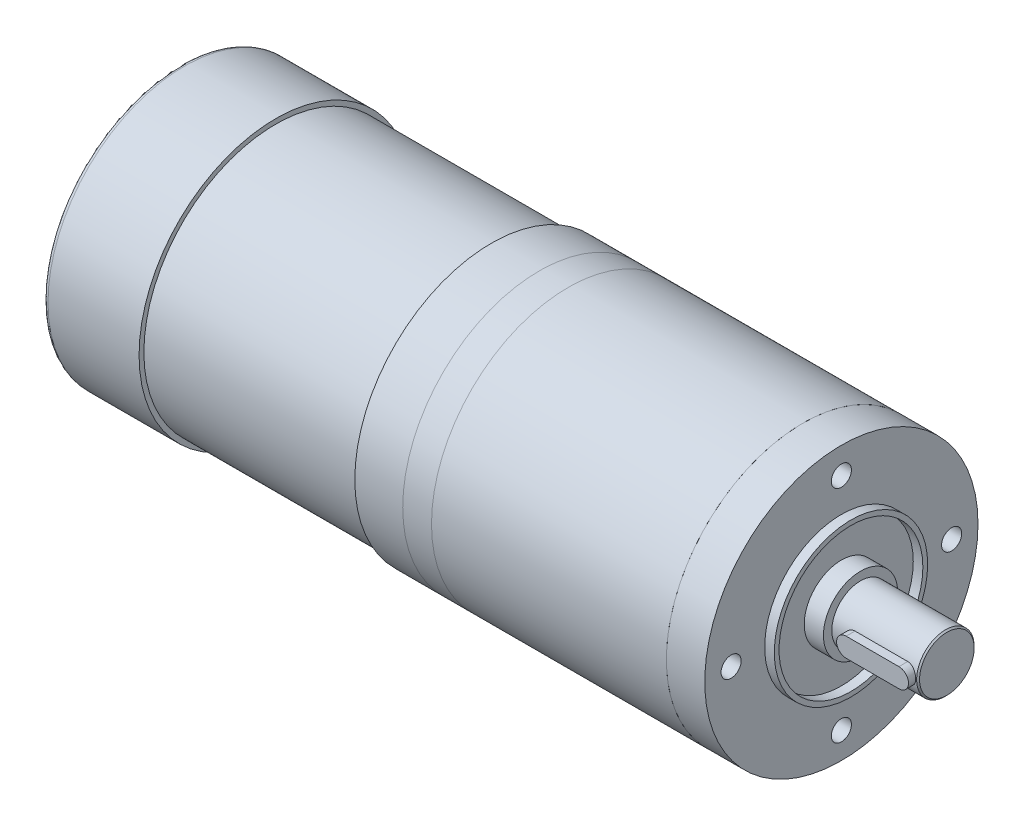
from build123d import *

# Parameters (mm, degrees)
SKETCH_1_R                  = 28.5
EXTRUDE_1_DEPTH             = 8
SKETCH_2_R                  = 28.5
EXTRUDE_2_DEPTH             = 49
SKETCH_3_R                  = 28.5
EXTRUDE_3_DEPTH             = 6
SKETCH_4_R                  = 28.5
EXTRUDE_4_DEPTH             = 10
SKETCH_5_R                  = 27.5
EXTRUDE_5_DEPTH             = 45
SKETCH_6_R                  = 28.5
EXTRUDE_6_DEPTH             = 20
FILLET_1_R                  = 1
SKETCH_7_R                  = 16
SKETCH_7_R_2                = 15
EXTRUDE_7_DEPTH             = 2
SKETCH_8_R                  = 7.75
EXTRUDE_8_DEPTH             = 4
SKETCH_9_R                  = 6
EXTRUDE_9_DEPTH             = 18
HOLE_WIZARD_M5_1_AT_2_COUNT = 2
HOLE_WIZARD_M5_1_AT_2_PITCH = 32.526911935
HOLE_WIZARD_M5_1_AT_3_COUNT = 2
HOLE_WIZARD_M5_1_AT_3_PITCH = 46
HOLE_WIZARD_M5_1_AT_4_COUNT = 2
HOLE_WIZARD_M5_1_AT_4_PITCH = 32.526911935
CUT_EXTRUDE_1_DEPTH         = 2.5
EXTRUDE_10_DEPTH            = 4
CHAMFER_1_SIZE              = 0.3


with BuildPart() as part:
    # Sketch 1 → Extrude 1 (new body)
    with BuildSketch(Plane(origin=(0, 0, 0), x_dir=(0, 0, -1), z_dir=(1, 0, 0))):
        Circle(SKETCH_1_R)
    extrude(amount=-EXTRUDE_1_DEPTH)

    # Sketch 7 → Extrude 7 (add)
    with BuildSketch(Plane(origin=(0, 0, 0), x_dir=(0, 0, -1), z_dir=(1, 0, 0))):
        Circle(SKETCH_7_R)
        Circle(SKETCH_7_R_2, mode=Mode.SUBTRACT)
    extrude(amount=EXTRUDE_7_DEPTH)

    # Sketch 8 → Extrude 8 (add)
    with BuildSketch(Plane(origin=(0, 0, 0), x_dir=(0, 0, -1), z_dir=(1, 0, 0))):
        Circle(SKETCH_8_R)
    extrude(amount=EXTRUDE_8_DEPTH)

    # Sketch 9 → Extrude 9 (add)
    with BuildSketch(Plane(origin=(4, 0, 0), x_dir=(0, 0, -1), z_dir=(1, 0, 0))):
        Circle(SKETCH_9_R)
    extrude(amount=EXTRUDE_9_DEPTH)


with BuildPart() as body_2:
    # Sketch 2 → Extrude 2 (new body)
    with BuildSketch(Plane.ZY.offset(8)):
        Circle(SKETCH_2_R)
    extrude(amount=EXTRUDE_2_DEPTH)


with BuildPart() as body_3:
    # Sketch 3 → Extrude 3 (new body)
    with BuildSketch(Plane.ZY.offset(57)):
        Circle(SKETCH_3_R)
    extrude(amount=EXTRUDE_3_DEPTH)


with BuildPart() as body_4:
    # Sketch 4 → Extrude 4 (new body)
    with BuildSketch(Plane.ZY.offset(63)):
        Circle(SKETCH_4_R)
    extrude(amount=EXTRUDE_4_DEPTH)

    # Sketch 5 → Extrude 5 (add)
    with BuildSketch(Plane.ZY.offset(73)):
        with Locations(Location((0, 0, 0), (0, 0, 180))):
            Circle(SKETCH_5_R)
    extrude(amount=EXTRUDE_5_DEPTH)

    # Sketch 6 → Extrude 6 (add)
    with BuildSketch(Plane.ZY.offset(118)):
        Circle(SKETCH_6_R)
    extrude(amount=EXTRUDE_6_DEPTH)

    # Fillet 1
    fillet_1_edges = [body_4.edges().sort_by_distance(p)[0] for p in [
        (-138, 0, -28.5),
    ]]
    fillet(fillet_1_edges, radius=FILLET_1_R)


with BuildPart() as hole_wizard_m5_1_tool:
    # Sketch 11 → Hole Wizard M5 _1 (revolve)
    with BuildSketch(Plane(origin=(0, 23, 0), x_dir=(0, 0, -1), z_dir=(0, 1, 0))):
        Polygon((0, 0), (0, 15.2618073), (2.1, 14), (2.1, 0), align=None)
    hole_wizard_m5_1 = revolve(axis=Axis((6.35, 23, 0), (-1, 0, 0)))


with BuildPart() as part_1:
    add(part.part)

    # Hole Wizard M5 _1: cut by hole_wizard_m5_1_tool
    add(hole_wizard_m5_1_tool.part, mode=Mode.SUBTRACT)


with BuildPart() as body_2_1:
    add(body_2.part)

    # Hole Wizard M5 _1: cut by hole_wizard_m5_1_tool
    add(hole_wizard_m5_1_tool.part, mode=Mode.SUBTRACT)


with BuildPart() as hole_wizard_m5_1_at_2_tool:
    # Hole Wizard M5 _1 at 2: Hole Wizard M5 _1 ×2
    with Locations(*[Vector(0, -0.7071067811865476, -0.7071067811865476) * (i * HOLE_WIZARD_M5_1_AT_2_PITCH) for i in range(1, HOLE_WIZARD_M5_1_AT_2_COUNT)]):
        add(hole_wizard_m5_1)


with BuildPart() as part_2:
    add(part_1.part)

    # Hole Wizard M5 _1 at 2: cut by hole_wizard_m5_1_at_2_tool
    add(hole_wizard_m5_1_at_2_tool.part, mode=Mode.SUBTRACT)


with BuildPart() as body_2_2:
    add(body_2_1.part)

    # Hole Wizard M5 _1 at 2: cut by hole_wizard_m5_1_at_2_tool
    add(hole_wizard_m5_1_at_2_tool.part, mode=Mode.SUBTRACT)


with BuildPart() as hole_wizard_m5_1_at_3_tool:
    # Hole Wizard M5 _1 at 3: Hole Wizard M5 _1 ×2
    with Locations(*[(0, -i * HOLE_WIZARD_M5_1_AT_3_PITCH, 0) for i in range(1, HOLE_WIZARD_M5_1_AT_3_COUNT)]):
        add(hole_wizard_m5_1)


with BuildPart() as part_3:
    add(part_2.part)

    # Hole Wizard M5 _1 at 3: cut by hole_wizard_m5_1_at_3_tool
    add(hole_wizard_m5_1_at_3_tool.part, mode=Mode.SUBTRACT)


with BuildPart() as body_2_3:
    add(body_2_2.part)

    # Hole Wizard M5 _1 at 3: cut by hole_wizard_m5_1_at_3_tool
    add(hole_wizard_m5_1_at_3_tool.part, mode=Mode.SUBTRACT)


with BuildPart() as hole_wizard_m5_1_at_4_tool:
    # Hole Wizard M5 _1 at 4: Hole Wizard M5 _1 ×2
    with Locations(*[Vector(0, -0.7071067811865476, 0.7071067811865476) * (i * HOLE_WIZARD_M5_1_AT_4_PITCH) for i in range(1, HOLE_WIZARD_M5_1_AT_4_COUNT)]):
        add(hole_wizard_m5_1)


with BuildPart() as part_4:
    add(part_3.part)

    # Hole Wizard M5 _1 at 4: cut by hole_wizard_m5_1_at_4_tool
    add(hole_wizard_m5_1_at_4_tool.part, mode=Mode.SUBTRACT)

    # Sketch 12 → Cut-Extrude 1 (cut)
    with BuildSketch(Plane.XY.offset(6)):
        with BuildLine():
            Line((8.5, 2), (19.5, 2))
            ThreePointArc((19.5, 2), (21.5, 0), (19.5, -2))
            Line((19.5, -2), (8.5, -2))
            ThreePointArc((8.5, -2), (6.5, 0), (8.5, 2))
        make_face()
    extrude(amount=-CUT_EXTRUDE_1_DEPTH, mode=Mode.SUBTRACT)

    # Chamfer 1
    chamfer_1_edges = [part_4.edges().sort_by_distance(p)[0] for p in [
        (22, 0, 6),
    ]]
    chamfer(chamfer_1_edges, length=CHAMFER_1_SIZE)


with BuildPart() as body_2_4:
    add(body_2_3.part)

    # Hole Wizard M5 _1 at 4: cut by hole_wizard_m5_1_at_4_tool
    add(hole_wizard_m5_1_at_4_tool.part, mode=Mode.SUBTRACT)


with BuildPart() as body_5:
    # Sketch 13 → Extrude 10 (new body)
    with BuildSketch(Plane.XY.offset(3.5)):
        with BuildLine():
            Line((8.5, 2), (19.5, 2))
            ThreePointArc((19.5, 2), (21.5, 0), (19.5, -2))
            Line((19.5, -2), (8.5, -2))
            ThreePointArc((8.5, -2), (6.5, 0), (8.5, 2))
        make_face()
    extrude(amount=EXTRUDE_10_DEPTH)


solid = Compound([body_3.part, body_4.part, part_4.part, body_2_4.part, body_5.part])
